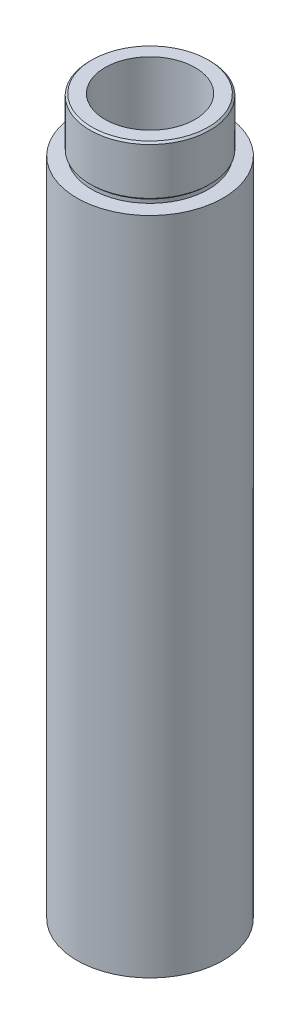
from build123d import *


with BuildPart() as part:
    # Sketch1 → Base-Revolve (revolve)
    with BuildSketch(Plane.XY, mode=Mode.PRIVATE) as base_revolve_sk:
        Polygon((12.7, 0), (15.4686, 0), (15.4686, 139.7), (12.319, 139.7), (12.319, 140.49375), (12.7, 140.87475), (12.7, 150.749), (12.319, 151.13), (9.525, 151.13), (9.525, 12.7), (12.7, 12.7), (12.7, 11.90625), (12.319, 11.52525), (12.319, 0.381), align=None)
    revolve(base_revolve_sk.sketch.rotate(Axis((0, 0, 0), (0, 1, 0)), 90), axis=Axis((0, 0, 0), (0, 1, 0)))


solid = part.part
